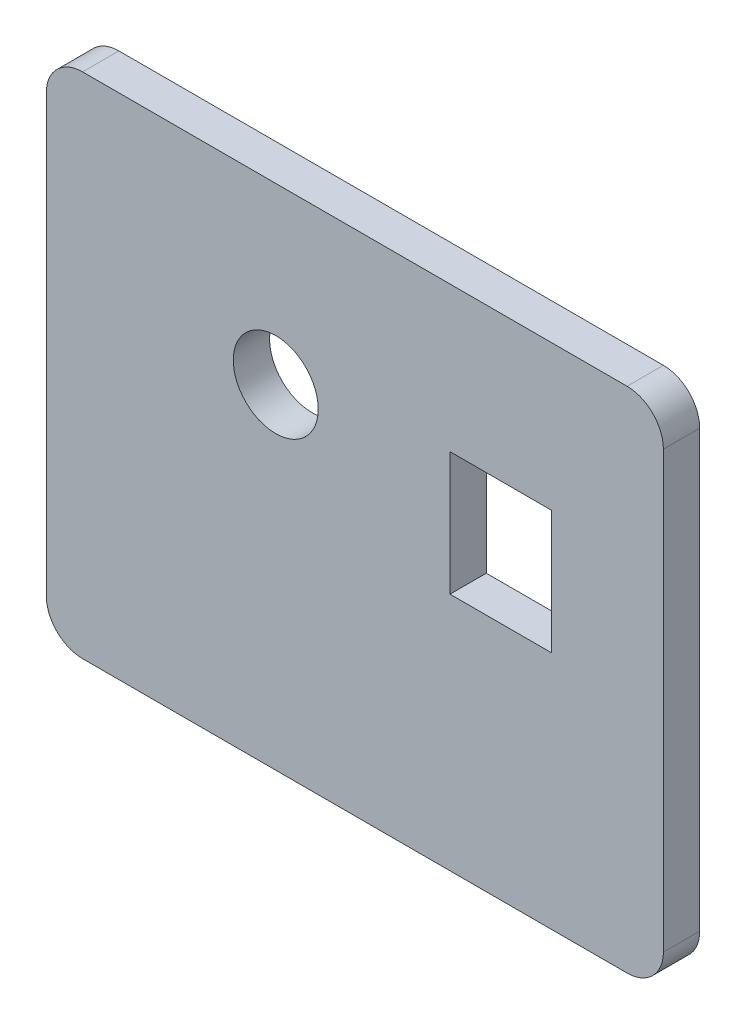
ISO-10303-21;
HEADER;
FILE_DESCRIPTION(('STEP AP214'),'2;1');
FILE_NAME('part.step','',(''),(''),'','','');
FILE_SCHEMA(('AUTOMOTIVE_DESIGN { 1 0 10303 214 1 1 1 1 }'));
ENDSEC;
DATA;
#1=APPLICATION_CONTEXT('core data for automotive mechanical design processes');
#2=APPLICATION_PROTOCOL_DEFINITION('international standard','automotive_design',2000,#1);
#3=PRODUCT_CONTEXT('',#1,'mechanical');
#4=PRODUCT('Part','Part','',(#3));
#5=PRODUCT_RELATED_PRODUCT_CATEGORY('part','',(#4));
#6=PRODUCT_DEFINITION_FORMATION('','',#4);
#7=PRODUCT_DEFINITION_CONTEXT('part definition',#1,'design');
#8=PRODUCT_DEFINITION('design','',#6,#7);
#9=PRODUCT_DEFINITION_SHAPE('','',#8);
#10=(LENGTH_UNIT() NAMED_UNIT(*) SI_UNIT(.MILLI.,.METRE.));
#11=(NAMED_UNIT(*) PLANE_ANGLE_UNIT() SI_UNIT($,.RADIAN.));
#12=(NAMED_UNIT(*) SI_UNIT($,.STERADIAN.) SOLID_ANGLE_UNIT());
#13=UNCERTAINTY_MEASURE_WITH_UNIT(LENGTH_MEASURE(1.E-05),#10,'distance_accuracy_value','');
#14=(GEOMETRIC_REPRESENTATION_CONTEXT(3) GLOBAL_UNCERTAINTY_ASSIGNED_CONTEXT((#13)) GLOBAL_UNIT_ASSIGNED_CONTEXT((#10,
#11,#12)) REPRESENTATION_CONTEXT('',''));
#15=CARTESIAN_POINT('',(0.,0.,0.));
#16=DIRECTION('',(0.,0.,1.));
#17=DIRECTION('',(1.,0.,0.));
#18=AXIS2_PLACEMENT_3D('',#15,#16,#17);
#19=CARTESIAN_POINT('',(37.5,30.,5.));
#20=DIRECTION('',(0.,0.,-1.));
#21=DIRECTION('',(-1.,0.,0.));
#22=AXIS2_PLACEMENT_3D('',#19,#20,#21);
#23=CYLINDRICAL_SURFACE('',#22,5.);
#24=CARTESIAN_POINT('',(37.5,30.,0.));
#25=DIRECTION('',(0.,0.,1.));
#26=DIRECTION('',(1.,0.,0.));
#27=AXIS2_PLACEMENT_3D('',#24,#25,#26);
#28=CIRCLE('',#27,5.);
#29=CARTESIAN_POINT('',(42.5,30.,0.));
#30=VERTEX_POINT('',#29);
#31=CARTESIAN_POINT('',(37.5,35.,0.));
#32=VERTEX_POINT('',#31);
#33=EDGE_CURVE('E192',#30,#32,#28,.T.);
#34=ORIENTED_EDGE('',*,*,#33,.T.);
#35=DIRECTION('',(0.,0.,-1.));
#36=VECTOR('',#35,1.);
#37=CARTESIAN_POINT('',(37.5,35.,5.));
#38=LINE('',#37,#36);
#39=CARTESIAN_POINT('',(37.5,35.,5.));
#40=VERTEX_POINT('',#39);
#41=EDGE_CURVE('E243',#40,#32,#38,.T.);
#42=ORIENTED_EDGE('',*,*,#41,.F.);
#43=CARTESIAN_POINT('',(37.5,30.,5.));
#44=DIRECTION('',(0.,0.,1.));
#45=DIRECTION('',(1.,0.,0.));
#46=AXIS2_PLACEMENT_3D('',#43,#44,#45);
#47=CIRCLE('',#46,5.);
#48=CARTESIAN_POINT('',(42.5,30.,5.));
#49=VERTEX_POINT('',#48);
#50=EDGE_CURVE('E165',#49,#40,#47,.T.);
#51=ORIENTED_EDGE('',*,*,#50,.F.);
#52=DIRECTION('',(0.,0.,-1.));
#53=VECTOR('',#52,1.);
#54=CARTESIAN_POINT('',(42.5,30.,5.));
#55=LINE('',#54,#53);
#56=EDGE_CURVE('E191',#49,#30,#55,.T.);
#57=ORIENTED_EDGE('',*,*,#56,.T.);
#58=EDGE_LOOP('',(#34,#42,#51,#57));
#59=FACE_BOUND('',#58,.T.);
#60=ADVANCED_FACE('F39',(#59),#23,.T.);
#61=CARTESIAN_POINT('',(-37.5,35.,5.));
#62=DIRECTION('',(0.,-1.,0.));
#63=DIRECTION('',(0.,0.,-1.));
#64=AXIS2_PLACEMENT_3D('',#61,#62,#63);
#65=PLANE('',#64);
#66=DIRECTION('',(-1.,0.,0.));
#67=VECTOR('',#66,1.);
#68=CARTESIAN_POINT('',(-37.5,35.,0.));
#69=LINE('',#68,#67);
#70=CARTESIAN_POINT('',(-37.5,35.,0.));
#71=VERTEX_POINT('',#70);
#72=EDGE_CURVE('E196',#32,#71,#69,.T.);
#73=ORIENTED_EDGE('',*,*,#72,.T.);
#74=DIRECTION('',(0.,0.,-1.));
#75=VECTOR('',#74,1.);
#76=CARTESIAN_POINT('',(-37.5,35.,5.));
#77=LINE('',#76,#75);
#78=CARTESIAN_POINT('',(-37.5,35.,5.));
#79=VERTEX_POINT('',#78);
#80=EDGE_CURVE('E239',#79,#71,#77,.T.);
#81=ORIENTED_EDGE('',*,*,#80,.F.);
#82=DIRECTION('',(-1.,0.,0.));
#83=VECTOR('',#82,1.);
#84=CARTESIAN_POINT('',(-37.5,35.,5.));
#85=LINE('',#84,#83);
#86=EDGE_CURVE('E169',#40,#79,#85,.T.);
#87=ORIENTED_EDGE('',*,*,#86,.F.);
#88=ORIENTED_EDGE('',*,*,#41,.T.);
#89=EDGE_LOOP('',(#73,#81,#87,#88));
#90=FACE_BOUND('',#89,.T.);
#91=ADVANCED_FACE('F273',(#90),#65,.F.);
#92=CARTESIAN_POINT('',(-37.5,30.,5.));
#93=DIRECTION('',(0.,0.,-1.));
#94=DIRECTION('',(-1.,0.,0.));
#95=AXIS2_PLACEMENT_3D('',#92,#93,#94);
#96=CYLINDRICAL_SURFACE('',#95,5.);
#97=CARTESIAN_POINT('',(-37.5,30.,0.));
#98=DIRECTION('',(0.,0.,1.));
#99=DIRECTION('',(-1.,0.,0.));
#100=AXIS2_PLACEMENT_3D('',#97,#98,#99);
#101=CIRCLE('',#100,5.);
#102=CARTESIAN_POINT('',(-42.5,30.,0.));
#103=VERTEX_POINT('',#102);
#104=EDGE_CURVE('E199',#71,#103,#101,.T.);
#105=ORIENTED_EDGE('',*,*,#104,.T.);
#106=DIRECTION('',(0.,0.,-1.));
#107=VECTOR('',#106,1.);
#108=CARTESIAN_POINT('',(-42.5,30.,5.));
#109=LINE('',#108,#107);
#110=CARTESIAN_POINT('',(-42.5,30.,5.));
#111=VERTEX_POINT('',#110);
#112=EDGE_CURVE('E235',#111,#103,#109,.T.);
#113=ORIENTED_EDGE('',*,*,#112,.F.);
#114=CARTESIAN_POINT('',(-37.5,30.,5.));
#115=DIRECTION('',(0.,0.,1.));
#116=DIRECTION('',(-1.,0.,0.));
#117=AXIS2_PLACEMENT_3D('',#114,#115,#116);
#118=CIRCLE('',#117,5.);
#119=EDGE_CURVE('E173',#79,#111,#118,.T.);
#120=ORIENTED_EDGE('',*,*,#119,.F.);
#121=ORIENTED_EDGE('',*,*,#80,.T.);
#122=EDGE_LOOP('',(#105,#113,#120,#121));
#123=FACE_BOUND('',#122,.T.);
#124=ADVANCED_FACE('F278',(#123),#96,.T.);
#125=CARTESIAN_POINT('',(-42.5,30.,5.));
#126=DIRECTION('',(1.,0.,0.));
#127=DIRECTION('',(0.,0.,-1.));
#128=AXIS2_PLACEMENT_3D('',#125,#126,#127);
#129=PLANE('',#128);
#130=DIRECTION('',(0.,-1.,0.));
#131=VECTOR('',#130,1.);
#132=CARTESIAN_POINT('',(-42.5,30.,0.));
#133=LINE('',#132,#131);
#134=CARTESIAN_POINT('',(-42.5,-30.,0.));
#135=VERTEX_POINT('',#134);
#136=EDGE_CURVE('E202',#103,#135,#133,.T.);
#137=ORIENTED_EDGE('',*,*,#136,.T.);
#138=DIRECTION('',(0.,0.,-1.));
#139=VECTOR('',#138,1.);
#140=CARTESIAN_POINT('',(-42.5,-30.,5.));
#141=LINE('',#140,#139);
#142=CARTESIAN_POINT('',(-42.5,-30.,5.));
#143=VERTEX_POINT('',#142);
#144=EDGE_CURVE('E231',#143,#135,#141,.T.);
#145=ORIENTED_EDGE('',*,*,#144,.F.);
#146=DIRECTION('',(0.,-1.,0.));
#147=VECTOR('',#146,1.);
#148=CARTESIAN_POINT('',(-42.5,30.,5.));
#149=LINE('',#148,#147);
#150=EDGE_CURVE('E176',#111,#143,#149,.T.);
#151=ORIENTED_EDGE('',*,*,#150,.F.);
#152=ORIENTED_EDGE('',*,*,#112,.T.);
#153=EDGE_LOOP('',(#137,#145,#151,#152));
#154=FACE_BOUND('',#153,.T.);
#155=ADVANCED_FACE('F310',(#154),#129,.F.);
#156=CARTESIAN_POINT('',(-37.5,-30.,5.));
#157=DIRECTION('',(0.,0.,-1.));
#158=DIRECTION('',(-1.,0.,0.));
#159=AXIS2_PLACEMENT_3D('',#156,#157,#158);
#160=CYLINDRICAL_SURFACE('',#159,5.);
#161=CARTESIAN_POINT('',(-37.5,-30.,0.));
#162=DIRECTION('',(0.,0.,1.));
#163=DIRECTION('',(-1.,0.,0.));
#164=AXIS2_PLACEMENT_3D('',#161,#162,#163);
#165=CIRCLE('',#164,5.);
#166=CARTESIAN_POINT('',(-37.5,-35.,0.));
#167=VERTEX_POINT('',#166);
#168=EDGE_CURVE('E205',#135,#167,#165,.T.);
#169=ORIENTED_EDGE('',*,*,#168,.T.);
#170=DIRECTION('',(0.,0.,-1.));
#171=VECTOR('',#170,1.);
#172=CARTESIAN_POINT('',(-37.5,-35.,5.));
#173=LINE('',#172,#171);
#174=CARTESIAN_POINT('',(-37.5,-35.,5.));
#175=VERTEX_POINT('',#174);
#176=EDGE_CURVE('E227',#175,#167,#173,.T.);
#177=ORIENTED_EDGE('',*,*,#176,.F.);
#178=CARTESIAN_POINT('',(-37.5,-30.,5.));
#179=DIRECTION('',(0.,0.,1.));
#180=DIRECTION('',(-1.,0.,0.));
#181=AXIS2_PLACEMENT_3D('',#178,#179,#180);
#182=CIRCLE('',#181,5.);
#183=EDGE_CURVE('E179',#143,#175,#182,.T.);
#184=ORIENTED_EDGE('',*,*,#183,.F.);
#185=ORIENTED_EDGE('',*,*,#144,.T.);
#186=EDGE_LOOP('',(#169,#177,#184,#185));
#187=FACE_BOUND('',#186,.T.);
#188=ADVANCED_FACE('F306',(#187),#160,.T.);
#189=CARTESIAN_POINT('',(-37.5,-35.,5.));
#190=DIRECTION('',(0.,1.,0.));
#191=DIRECTION('',(0.,0.,1.));
#192=AXIS2_PLACEMENT_3D('',#189,#190,#191);
#193=PLANE('',#192);
#194=DIRECTION('',(1.,0.,0.));
#195=VECTOR('',#194,1.);
#196=CARTESIAN_POINT('',(-37.5,-35.,0.));
#197=LINE('',#196,#195);
#198=CARTESIAN_POINT('',(37.5,-35.,0.));
#199=VERTEX_POINT('',#198);
#200=EDGE_CURVE('E208',#167,#199,#197,.T.);
#201=ORIENTED_EDGE('',*,*,#200,.T.);
#202=DIRECTION('',(0.,0.,-1.));
#203=VECTOR('',#202,1.);
#204=CARTESIAN_POINT('',(37.5,-35.,5.));
#205=LINE('',#204,#203);
#206=CARTESIAN_POINT('',(37.5,-35.,5.));
#207=VERTEX_POINT('',#206);
#208=EDGE_CURVE('E223',#207,#199,#205,.T.);
#209=ORIENTED_EDGE('',*,*,#208,.F.);
#210=DIRECTION('',(1.,0.,0.));
#211=VECTOR('',#210,1.);
#212=CARTESIAN_POINT('',(-37.5,-35.,5.));
#213=LINE('',#212,#211);
#214=EDGE_CURVE('E182',#175,#207,#213,.T.);
#215=ORIENTED_EDGE('',*,*,#214,.F.);
#216=ORIENTED_EDGE('',*,*,#176,.T.);
#217=EDGE_LOOP('',(#201,#209,#215,#216));
#218=FACE_BOUND('',#217,.T.);
#219=ADVANCED_FACE('F301',(#218),#193,.F.);
#220=CARTESIAN_POINT('',(37.5,-30.,5.));
#221=DIRECTION('',(0.,0.,-1.));
#222=DIRECTION('',(-1.,0.,0.));
#223=AXIS2_PLACEMENT_3D('',#220,#221,#222);
#224=CYLINDRICAL_SURFACE('',#223,5.);
#225=CARTESIAN_POINT('',(37.5,-30.,0.));
#226=DIRECTION('',(0.,0.,1.));
#227=DIRECTION('',(-1.,0.,0.));
#228=AXIS2_PLACEMENT_3D('',#225,#226,#227);
#229=CIRCLE('',#228,5.);
#230=CARTESIAN_POINT('',(42.5,-30.,0.));
#231=VERTEX_POINT('',#230);
#232=EDGE_CURVE('E211',#199,#231,#229,.T.);
#233=ORIENTED_EDGE('',*,*,#232,.T.);
#234=DIRECTION('',(0.,0.,-1.));
#235=VECTOR('',#234,1.);
#236=CARTESIAN_POINT('',(42.5,-30.,5.));
#237=LINE('',#236,#235);
#238=CARTESIAN_POINT('',(42.5,-30.,5.));
#239=VERTEX_POINT('',#238);
#240=EDGE_CURVE('E219',#239,#231,#237,.T.);
#241=ORIENTED_EDGE('',*,*,#240,.F.);
#242=CARTESIAN_POINT('',(37.5,-30.,5.));
#243=DIRECTION('',(0.,0.,1.));
#244=DIRECTION('',(-1.,0.,0.));
#245=AXIS2_PLACEMENT_3D('',#242,#243,#244);
#246=CIRCLE('',#245,5.);
#247=EDGE_CURVE('E185',#207,#239,#246,.T.);
#248=ORIENTED_EDGE('',*,*,#247,.F.);
#249=ORIENTED_EDGE('',*,*,#208,.T.);
#250=EDGE_LOOP('',(#233,#241,#248,#249));
#251=FACE_BOUND('',#250,.T.);
#252=ADVANCED_FACE('F296',(#251),#224,.T.);
#253=CARTESIAN_POINT('',(42.5,30.,5.));
#254=DIRECTION('',(-1.,0.,0.));
#255=DIRECTION('',(0.,-1.,0.));
#256=AXIS2_PLACEMENT_3D('',#253,#254,#255);
#257=PLANE('',#256);
#258=DIRECTION('',(0.,1.,0.));
#259=VECTOR('',#258,1.);
#260=CARTESIAN_POINT('',(42.5,30.,0.));
#261=LINE('',#260,#259);
#262=EDGE_CURVE('E170',#231,#30,#261,.T.);
#263=ORIENTED_EDGE('',*,*,#262,.T.);
#264=ORIENTED_EDGE('',*,*,#56,.F.);
#265=DIRECTION('',(0.,1.,0.));
#266=VECTOR('',#265,1.);
#267=CARTESIAN_POINT('',(42.5,30.,5.));
#268=LINE('',#267,#266);
#269=EDGE_CURVE('E188',#239,#49,#268,.T.);
#270=ORIENTED_EDGE('',*,*,#269,.F.);
#271=ORIENTED_EDGE('',*,*,#240,.T.);
#272=EDGE_LOOP('',(#263,#264,#270,#271));
#273=FACE_BOUND('',#272,.T.);
#274=ADVANCED_FACE('F294',(#273),#257,.F.);
#275=CARTESIAN_POINT('',(37.5,30.,5.));
#276=DIRECTION('',(0.,0.,1.));
#277=DIRECTION('',(1.,0.,0.));
#278=AXIS2_PLACEMENT_3D('',#275,#276,#277);
#279=PLANE('',#278);
#280=CARTESIAN_POINT('',(-10.8951194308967,11.,5.));
#281=DIRECTION('',(0.,0.,1.));
#282=DIRECTION('',(1.,0.,0.));
#283=AXIS2_PLACEMENT_3D('',#280,#281,#282);
#284=CIRCLE('',#283,5.85);
#285=CARTESIAN_POINT('',(-5.04511943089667,11.,5.));
#286=VERTEX_POINT('',#285);
#287=EDGE_CURVE('E160',#286,#286,#284,.T.);
#288=ORIENTED_EDGE('',*,*,#287,.F.);
#289=EDGE_LOOP('',(#288));
#290=FACE_BOUND('',#289,.T.);
#291=DIRECTION('',(0.,1.,0.));
#292=VECTOR('',#291,1.);
#293=CARTESIAN_POINT('',(27.1048805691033,15.,5.));
#294=LINE('',#293,#292);
#295=CARTESIAN_POINT('',(27.1048805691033,-2.,5.));
#296=VERTEX_POINT('',#295);
#297=CARTESIAN_POINT('',(27.1048805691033,15.,5.));
#298=VERTEX_POINT('',#297);
#299=EDGE_CURVE('E55',#296,#298,#294,.T.);
#300=ORIENTED_EDGE('',*,*,#299,.F.);
#301=DIRECTION('',(1.,0.,0.));
#302=VECTOR('',#301,1.);
#303=CARTESIAN_POINT('',(13.1048805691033,-2.,5.));
#304=LINE('',#303,#302);
#305=CARTESIAN_POINT('',(13.1048805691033,-2.,5.));
#306=VERTEX_POINT('',#305);
#307=EDGE_CURVE('E150',#306,#296,#304,.T.);
#308=ORIENTED_EDGE('',*,*,#307,.F.);
#309=DIRECTION('',(0.,-1.,0.));
#310=VECTOR('',#309,1.);
#311=CARTESIAN_POINT('',(13.1048805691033,15.,5.));
#312=LINE('',#311,#310);
#313=CARTESIAN_POINT('',(13.1048805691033,15.,5.));
#314=VERTEX_POINT('',#313);
#315=EDGE_CURVE('E132',#314,#306,#312,.T.);
#316=ORIENTED_EDGE('',*,*,#315,.F.);
#317=DIRECTION('',(-1.,0.,0.));
#318=VECTOR('',#317,1.);
#319=CARTESIAN_POINT('',(13.1048805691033,15.,5.));
#320=LINE('',#319,#318);
#321=EDGE_CURVE('E142',#298,#314,#320,.T.);
#322=ORIENTED_EDGE('',*,*,#321,.F.);
#323=EDGE_LOOP('',(#300,#308,#316,#322));
#324=FACE_BOUND('',#323,.T.);
#325=ORIENTED_EDGE('',*,*,#50,.T.);
#326=ORIENTED_EDGE('',*,*,#86,.T.);
#327=ORIENTED_EDGE('',*,*,#119,.T.);
#328=ORIENTED_EDGE('',*,*,#150,.T.);
#329=ORIENTED_EDGE('',*,*,#183,.T.);
#330=ORIENTED_EDGE('',*,*,#214,.T.);
#331=ORIENTED_EDGE('',*,*,#247,.T.);
#332=ORIENTED_EDGE('',*,*,#269,.T.);
#333=EDGE_LOOP('',(#325,#326,#327,#328,#329,#330,#331,#332));
#334=FACE_BOUND('',#333,.T.);
#335=ADVANCED_FACE('F147',(#290,#324,#334),#279,.T.);
#336=CARTESIAN_POINT('',(37.5,30.,0.));
#337=DIRECTION('',(0.,0.,1.));
#338=DIRECTION('',(1.,0.,0.));
#339=AXIS2_PLACEMENT_3D('',#336,#337,#338);
#340=PLANE('',#339);
#341=CARTESIAN_POINT('',(-10.8951194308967,11.,0.));
#342=DIRECTION('',(0.,0.,1.));
#343=DIRECTION('',(1.,0.,0.));
#344=AXIS2_PLACEMENT_3D('',#341,#342,#343);
#345=CIRCLE('',#344,5.85);
#346=CARTESIAN_POINT('',(-5.04511943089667,11.,0.));
#347=VERTEX_POINT('',#346);
#348=EDGE_CURVE('E42',#347,#347,#345,.T.);
#349=ORIENTED_EDGE('',*,*,#348,.T.);
#350=EDGE_LOOP('',(#349));
#351=FACE_BOUND('',#350,.T.);
#352=DIRECTION('',(1.,0.,0.));
#353=VECTOR('',#352,1.);
#354=CARTESIAN_POINT('',(37.5,-2.,0.));
#355=LINE('',#354,#353);
#356=CARTESIAN_POINT('',(13.1048805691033,-2.,0.));
#357=VERTEX_POINT('',#356);
#358=CARTESIAN_POINT('',(27.1048805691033,-2.,0.));
#359=VERTEX_POINT('',#358);
#360=EDGE_CURVE('E48',#357,#359,#355,.T.);
#361=ORIENTED_EDGE('',*,*,#360,.T.);
#362=DIRECTION('',(0.,1.,0.));
#363=VECTOR('',#362,1.);
#364=CARTESIAN_POINT('',(27.1048805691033,30.,0.));
#365=LINE('',#364,#363);
#366=CARTESIAN_POINT('',(27.1048805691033,15.,0.));
#367=VERTEX_POINT('',#366);
#368=EDGE_CURVE('E11',#359,#367,#365,.T.);
#369=ORIENTED_EDGE('',*,*,#368,.T.);
#370=DIRECTION('',(-1.,0.,0.));
#371=VECTOR('',#370,1.);
#372=CARTESIAN_POINT('',(37.5,15.,0.));
#373=LINE('',#372,#371);
#374=CARTESIAN_POINT('',(13.1048805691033,15.,0.));
#375=VERTEX_POINT('',#374);
#376=EDGE_CURVE('E247',#367,#375,#373,.T.);
#377=ORIENTED_EDGE('',*,*,#376,.T.);
#378=DIRECTION('',(0.,-1.,0.));
#379=VECTOR('',#378,1.);
#380=CARTESIAN_POINT('',(13.1048805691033,30.,0.));
#381=LINE('',#380,#379);
#382=EDGE_CURVE('E135',#375,#357,#381,.T.);
#383=ORIENTED_EDGE('',*,*,#382,.T.);
#384=EDGE_LOOP('',(#361,#369,#377,#383));
#385=FACE_BOUND('',#384,.T.);
#386=ORIENTED_EDGE('',*,*,#33,.F.);
#387=ORIENTED_EDGE('',*,*,#262,.F.);
#388=ORIENTED_EDGE('',*,*,#232,.F.);
#389=ORIENTED_EDGE('',*,*,#200,.F.);
#390=ORIENTED_EDGE('',*,*,#168,.F.);
#391=ORIENTED_EDGE('',*,*,#136,.F.);
#392=ORIENTED_EDGE('',*,*,#104,.F.);
#393=ORIENTED_EDGE('',*,*,#72,.F.);
#394=EDGE_LOOP('',(#386,#387,#388,#389,#390,#391,#392,#393));
#395=FACE_BOUND('',#394,.T.);
#396=ADVANCED_FACE('F255',(#351,#385,#395),#340,.F.);
#397=CARTESIAN_POINT('',(27.1048805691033,15.,-5.));
#398=DIRECTION('',(1.,0.,0.));
#399=DIRECTION('',(0.,1.,0.));
#400=AXIS2_PLACEMENT_3D('',#397,#398,#399);
#401=PLANE('',#400);
#402=DIRECTION('',(0.,0.,1.));
#403=VECTOR('',#402,1.);
#404=CARTESIAN_POINT('',(27.1048805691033,-2.,-5.));
#405=LINE('',#404,#403);
#406=EDGE_CURVE('E157',#359,#296,#405,.T.);
#407=ORIENTED_EDGE('',*,*,#406,.T.);
#408=ORIENTED_EDGE('',*,*,#299,.T.);
#409=DIRECTION('',(0.,0.,1.));
#410=VECTOR('',#409,1.);
#411=CARTESIAN_POINT('',(27.1048805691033,15.,-5.));
#412=LINE('',#411,#410);
#413=EDGE_CURVE('E139',#367,#298,#412,.T.);
#414=ORIENTED_EDGE('',*,*,#413,.F.);
#415=ORIENTED_EDGE('',*,*,#368,.F.);
#416=EDGE_LOOP('',(#407,#408,#414,#415));
#417=FACE_BOUND('',#416,.T.);
#418=ADVANCED_FACE('F260',(#417),#401,.F.);
#419=CARTESIAN_POINT('',(13.1048805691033,-2.,-5.));
#420=DIRECTION('',(0.,-1.,0.));
#421=DIRECTION('',(1.,0.,0.));
#422=AXIS2_PLACEMENT_3D('',#419,#420,#421);
#423=PLANE('',#422);
#424=DIRECTION('',(0.,0.,1.));
#425=VECTOR('',#424,1.);
#426=CARTESIAN_POINT('',(13.1048805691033,-2.,-5.));
#427=LINE('',#426,#425);
#428=EDGE_CURVE('E138',#357,#306,#427,.T.);
#429=ORIENTED_EDGE('',*,*,#428,.T.);
#430=ORIENTED_EDGE('',*,*,#307,.T.);
#431=ORIENTED_EDGE('',*,*,#406,.F.);
#432=ORIENTED_EDGE('',*,*,#360,.F.);
#433=EDGE_LOOP('',(#429,#430,#431,#432));
#434=FACE_BOUND('',#433,.T.);
#435=ADVANCED_FACE('F259',(#434),#423,.F.);
#436=CARTESIAN_POINT('',(13.1048805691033,15.,-5.));
#437=DIRECTION('',(-1.,0.,0.));
#438=DIRECTION('',(0.,-1.,0.));
#439=AXIS2_PLACEMENT_3D('',#436,#437,#438);
#440=PLANE('',#439);
#441=DIRECTION('',(0.,0.,1.));
#442=VECTOR('',#441,1.);
#443=CARTESIAN_POINT('',(13.1048805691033,15.,-5.));
#444=LINE('',#443,#442);
#445=EDGE_CURVE('E63',#375,#314,#444,.T.);
#446=ORIENTED_EDGE('',*,*,#445,.T.);
#447=ORIENTED_EDGE('',*,*,#315,.T.);
#448=ORIENTED_EDGE('',*,*,#428,.F.);
#449=ORIENTED_EDGE('',*,*,#382,.F.);
#450=EDGE_LOOP('',(#446,#447,#448,#449));
#451=FACE_BOUND('',#450,.T.);
#452=ADVANCED_FACE('F129',(#451),#440,.F.);
#453=CARTESIAN_POINT('',(13.1048805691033,15.,-5.));
#454=DIRECTION('',(0.,1.,0.));
#455=DIRECTION('',(0.,0.,1.));
#456=AXIS2_PLACEMENT_3D('',#453,#454,#455);
#457=PLANE('',#456);
#458=ORIENTED_EDGE('',*,*,#413,.T.);
#459=ORIENTED_EDGE('',*,*,#321,.T.);
#460=ORIENTED_EDGE('',*,*,#445,.F.);
#461=ORIENTED_EDGE('',*,*,#376,.F.);
#462=EDGE_LOOP('',(#458,#459,#460,#461));
#463=FACE_BOUND('',#462,.T.);
#464=ADVANCED_FACE('F143',(#463),#457,.F.);
#465=CARTESIAN_POINT('',(-10.8951194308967,11.,-5.));
#466=DIRECTION('',(0.,0.,1.));
#467=DIRECTION('',(1.,0.,0.));
#468=AXIS2_PLACEMENT_3D('',#465,#466,#467);
#469=CYLINDRICAL_SURFACE('',#468,5.85);
#470=ORIENTED_EDGE('',*,*,#287,.T.);
#471=EDGE_LOOP('',(#470));
#472=FACE_BOUND('',#471,.T.);
#473=ORIENTED_EDGE('',*,*,#348,.F.);
#474=EDGE_LOOP('',(#473));
#475=FACE_BOUND('',#474,.T.);
#476=ADVANCED_FACE('F341',(#472,#475),#469,.F.);
#477=CLOSED_SHELL('',(#60,#91,#124,#155,#188,#219,#252,#274,#335,#396,#418,#435,#452,#464,#476));
#478=MANIFOLD_SOLID_BREP('B2',#477);
#479=ADVANCED_BREP_SHAPE_REPRESENTATION('',(#18,#478),#14);
#480=SHAPE_DEFINITION_REPRESENTATION(#9,#479);
ENDSEC;
END-ISO-10303-21;
